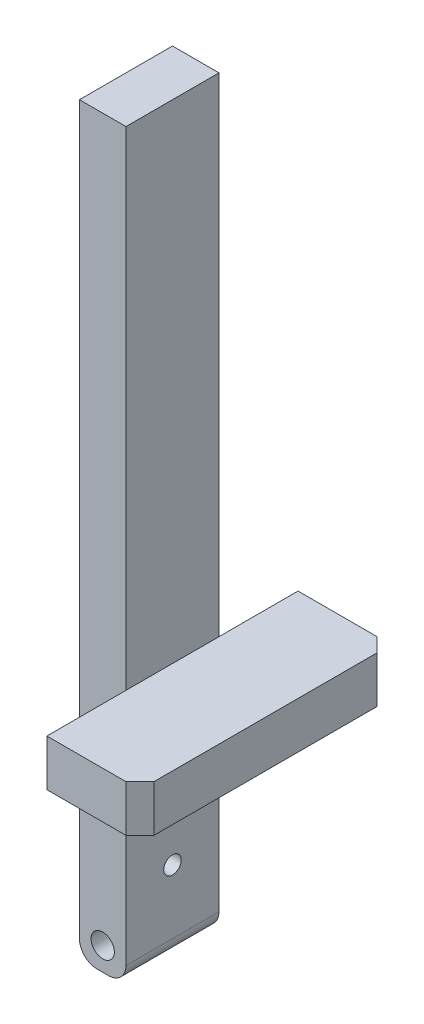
ISO-10303-21;
HEADER;
FILE_DESCRIPTION(('STEP AP214'),'2;1');
FILE_NAME('part.step','',(''),(''),'','','');
FILE_SCHEMA(('AUTOMOTIVE_DESIGN { 1 0 10303 214 1 1 1 1 }'));
ENDSEC;
DATA;
#1=APPLICATION_CONTEXT('core data for automotive mechanical design processes');
#2=APPLICATION_PROTOCOL_DEFINITION('international standard','automotive_design',2000,#1);
#3=PRODUCT_CONTEXT('',#1,'mechanical');
#4=PRODUCT('Part','Part','',(#3));
#5=PRODUCT_RELATED_PRODUCT_CATEGORY('part','',(#4));
#6=PRODUCT_DEFINITION_FORMATION('','',#4);
#7=PRODUCT_DEFINITION_CONTEXT('part definition',#1,'design');
#8=PRODUCT_DEFINITION('design','',#6,#7);
#9=PRODUCT_DEFINITION_SHAPE('','',#8);
#10=(LENGTH_UNIT() NAMED_UNIT(*) SI_UNIT(.MILLI.,.METRE.));
#11=(NAMED_UNIT(*) PLANE_ANGLE_UNIT() SI_UNIT($,.RADIAN.));
#12=(NAMED_UNIT(*) SI_UNIT($,.STERADIAN.) SOLID_ANGLE_UNIT());
#13=UNCERTAINTY_MEASURE_WITH_UNIT(LENGTH_MEASURE(1.E-05),#10,'distance_accuracy_value','');
#14=(GEOMETRIC_REPRESENTATION_CONTEXT(3) GLOBAL_UNCERTAINTY_ASSIGNED_CONTEXT((#13)) GLOBAL_UNIT_ASSIGNED_CONTEXT((#10,
#11,#12)) REPRESENTATION_CONTEXT('',''));
#15=CARTESIAN_POINT('',(0.,0.,0.));
#16=DIRECTION('',(0.,0.,1.));
#17=DIRECTION('',(1.,0.,0.));
#18=AXIS2_PLACEMENT_3D('',#15,#16,#17);
#19=CARTESIAN_POINT('',(6.35000000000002,50.8,34.29));
#20=DIRECTION('',(1.,0.,0.));
#21=DIRECTION('',(0.,1.,0.));
#22=AXIS2_PLACEMENT_3D('',#19,#20,#21);
#23=PLANE('',#22);
#24=CARTESIAN_POINT('',(6.35000000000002,57.15,-6.35));
#25=DIRECTION('',(1.,0.,0.));
#26=DIRECTION('',(0.,1.,0.));
#27=AXIS2_PLACEMENT_3D('',#24,#25,#26);
#28=CIRCLE('',#27,2.3876);
#29=CARTESIAN_POINT('',(6.35000000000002,59.5376,-6.35));
#30=VERTEX_POINT('',#29);
#31=EDGE_CURVE('E149',#30,#30,#28,.F.);
#32=ORIENTED_EDGE('',*,*,#31,.F.);
#33=EDGE_LOOP('',(#32));
#34=FACE_BOUND('',#33,.T.);
#35=DIRECTION('',(0.,-1.,0.));
#36=VECTOR('',#35,1.);
#37=CARTESIAN_POINT('',(6.35000000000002,50.8,-34.29));
#38=LINE('',#37,#36);
#39=CARTESIAN_POINT('',(6.35000000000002,63.5,-34.29));
#40=VERTEX_POINT('',#39);
#41=CARTESIAN_POINT('',(6.35000000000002,50.8,-34.29));
#42=VERTEX_POINT('',#41);
#43=EDGE_CURVE('E138',#40,#42,#38,.T.);
#44=ORIENTED_EDGE('',*,*,#43,.T.);
#45=DIRECTION('',(0.,0.,-1.));
#46=VECTOR('',#45,1.);
#47=CARTESIAN_POINT('',(6.35000000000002,50.8,34.29));
#48=LINE('',#47,#46);
#49=CARTESIAN_POINT('',(6.35000000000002,50.8,34.29));
#50=VERTEX_POINT('',#49);
#51=EDGE_CURVE('E121',#50,#42,#48,.T.);
#52=ORIENTED_EDGE('',*,*,#51,.F.);
#53=DIRECTION('',(0.,-1.,0.));
#54=VECTOR('',#53,1.);
#55=CARTESIAN_POINT('',(6.35000000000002,50.8,34.29));
#56=LINE('',#55,#54);
#57=CARTESIAN_POINT('',(6.35000000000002,63.5,34.29));
#58=VERTEX_POINT('',#57);
#59=EDGE_CURVE('E126',#58,#50,#56,.T.);
#60=ORIENTED_EDGE('',*,*,#59,.F.);
#61=DIRECTION('',(0.,0.,-1.));
#62=VECTOR('',#61,1.);
#63=CARTESIAN_POINT('',(6.35000000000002,63.5,34.29));
#64=LINE('',#63,#62);
#65=EDGE_CURVE('E180',#58,#40,#64,.T.);
#66=ORIENTED_EDGE('',*,*,#65,.T.);
#67=EDGE_LOOP('',(#44,#52,#60,#66));
#68=FACE_BOUND('',#67,.T.);
#69=CARTESIAN_POINT('',(6.35000000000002,57.15,6.35));
#70=DIRECTION('',(1.,0.,0.));
#71=DIRECTION('',(0.,1.,0.));
#72=AXIS2_PLACEMENT_3D('',#69,#70,#71);
#73=CIRCLE('',#72,2.3876);
#74=CARTESIAN_POINT('',(6.35000000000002,59.5376,6.35));
#75=VERTEX_POINT('',#74);
#76=EDGE_CURVE('E152',#75,#75,#73,.F.);
#77=ORIENTED_EDGE('',*,*,#76,.F.);
#78=EDGE_LOOP('',(#77));
#79=FACE_BOUND('',#78,.T.);
#80=ADVANCED_FACE('F64',(#34,#68,#79),#23,.F.);
#81=CARTESIAN_POINT('',(6.35000000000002,50.8,34.29));
#82=DIRECTION('',(0.,1.,0.));
#83=DIRECTION('',(0.,0.,1.));
#84=AXIS2_PLACEMENT_3D('',#81,#82,#83);
#85=PLANE('',#84);
#86=DIRECTION('',(1.,0.,0.));
#87=VECTOR('',#86,1.);
#88=CARTESIAN_POINT('',(6.35000000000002,50.8,-34.29));
#89=LINE('',#88,#87);
#90=CARTESIAN_POINT('',(27.94,50.8,-34.29));
#91=VERTEX_POINT('',#90);
#92=EDGE_CURVE('E164',#42,#91,#89,.T.);
#93=ORIENTED_EDGE('',*,*,#92,.T.);
#94=DIRECTION('',(-0.707106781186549,0.,-0.707106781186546));
#95=VECTOR('',#94,1.);
#96=CARTESIAN_POINT('',(31.75,50.8,-30.48));
#97=LINE('',#96,#95);
#98=CARTESIAN_POINT('',(31.75,50.8,-30.48));
#99=VERTEX_POINT('',#98);
#100=EDGE_CURVE('E72',#91,#99,#97,.F.);
#101=ORIENTED_EDGE('',*,*,#100,.T.);
#102=DIRECTION('',(0.,0.,-1.));
#103=VECTOR('',#102,1.);
#104=CARTESIAN_POINT('',(31.75,50.8,34.29));
#105=LINE('',#104,#103);
#106=CARTESIAN_POINT('',(31.75,50.8,30.48));
#107=VERTEX_POINT('',#106);
#108=EDGE_CURVE('E140',#107,#99,#105,.T.);
#109=ORIENTED_EDGE('',*,*,#108,.F.);
#110=DIRECTION('',(-0.707106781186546,0.,0.707106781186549));
#111=VECTOR('',#110,1.);
#112=CARTESIAN_POINT('',(27.94,50.8,34.29));
#113=LINE('',#112,#111);
#114=CARTESIAN_POINT('',(27.94,50.8,34.29));
#115=VERTEX_POINT('',#114);
#116=EDGE_CURVE('E79',#107,#115,#113,.T.);
#117=ORIENTED_EDGE('',*,*,#116,.T.);
#118=DIRECTION('',(1.,0.,0.));
#119=VECTOR('',#118,1.);
#120=CARTESIAN_POINT('',(6.35000000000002,50.8,34.29));
#121=LINE('',#120,#119);
#122=EDGE_CURVE('E117',#50,#115,#121,.T.);
#123=ORIENTED_EDGE('',*,*,#122,.F.);
#124=ORIENTED_EDGE('',*,*,#51,.T.);
#125=EDGE_LOOP('',(#93,#101,#109,#117,#123,#124));
#126=FACE_BOUND('',#125,.T.);
#127=ADVANCED_FACE('F119',(#126),#85,.F.);
#128=CARTESIAN_POINT('',(31.75,50.8,34.29));
#129=DIRECTION('',(-1.,0.,0.));
#130=DIRECTION('',(0.,0.,1.));
#131=AXIS2_PLACEMENT_3D('',#128,#129,#130);
#132=PLANE('',#131);
#133=ORIENTED_EDGE('',*,*,#108,.T.);
#134=DIRECTION('',(0.,1.,0.));
#135=VECTOR('',#134,1.);
#136=CARTESIAN_POINT('',(31.75,50.8,-30.48));
#137=LINE('',#136,#135);
#138=CARTESIAN_POINT('',(31.75,63.5,-30.48));
#139=VERTEX_POINT('',#138);
#140=EDGE_CURVE('E142',#99,#139,#137,.T.);
#141=ORIENTED_EDGE('',*,*,#140,.T.);
#142=DIRECTION('',(0.,0.,-1.));
#143=VECTOR('',#142,1.);
#144=CARTESIAN_POINT('',(31.75,63.5,34.29));
#145=LINE('',#144,#143);
#146=CARTESIAN_POINT('',(31.75,63.5,30.48));
#147=VERTEX_POINT('',#146);
#148=EDGE_CURVE('E145',#147,#139,#145,.T.);
#149=ORIENTED_EDGE('',*,*,#148,.F.);
#150=DIRECTION('',(0.,-1.,0.));
#151=VECTOR('',#150,1.);
#152=CARTESIAN_POINT('',(31.75,50.8,30.48));
#153=LINE('',#152,#151);
#154=EDGE_CURVE('E139',#147,#107,#153,.T.);
#155=ORIENTED_EDGE('',*,*,#154,.T.);
#156=EDGE_LOOP('',(#133,#141,#149,#155));
#157=FACE_BOUND('',#156,.T.);
#158=ADVANCED_FACE('F168',(#157),#132,.F.);
#159=CARTESIAN_POINT('',(31.75,63.5,34.29));
#160=DIRECTION('',(0.,-1.,0.));
#161=DIRECTION('',(0.,0.,-1.));
#162=AXIS2_PLACEMENT_3D('',#159,#160,#161);
#163=PLANE('',#162);
#164=ORIENTED_EDGE('',*,*,#148,.T.);
#165=DIRECTION('',(0.707106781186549,0.,0.707106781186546));
#166=VECTOR('',#165,1.);
#167=CARTESIAN_POINT('',(31.75,63.5,-30.48));
#168=LINE('',#167,#166);
#169=CARTESIAN_POINT('',(27.94,63.5,-34.29));
#170=VERTEX_POINT('',#169);
#171=EDGE_CURVE('E160',#139,#170,#168,.F.);
#172=ORIENTED_EDGE('',*,*,#171,.T.);
#173=DIRECTION('',(-1.,0.,0.));
#174=VECTOR('',#173,1.);
#175=CARTESIAN_POINT('',(31.75,63.5,-34.29));
#176=LINE('',#175,#174);
#177=EDGE_CURVE('E134',#170,#40,#176,.T.);
#178=ORIENTED_EDGE('',*,*,#177,.T.);
#179=ORIENTED_EDGE('',*,*,#65,.F.);
#180=DIRECTION('',(-1.,0.,0.));
#181=VECTOR('',#180,1.);
#182=CARTESIAN_POINT('',(31.75,63.5,34.29));
#183=LINE('',#182,#181);
#184=CARTESIAN_POINT('',(27.94,63.5,34.29));
#185=VERTEX_POINT('',#184);
#186=EDGE_CURVE('E125',#185,#58,#183,.T.);
#187=ORIENTED_EDGE('',*,*,#186,.F.);
#188=DIRECTION('',(0.707106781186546,0.,-0.707106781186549));
#189=VECTOR('',#188,1.);
#190=CARTESIAN_POINT('',(27.94,63.5,34.29));
#191=LINE('',#190,#189);
#192=EDGE_CURVE('E158',#185,#147,#191,.T.);
#193=ORIENTED_EDGE('',*,*,#192,.T.);
#194=EDGE_LOOP('',(#164,#172,#178,#179,#187,#193));
#195=FACE_BOUND('',#194,.T.);
#196=ADVANCED_FACE('F174',(#195),#163,.F.);
#197=CARTESIAN_POINT('',(0.,0.,34.29));
#198=DIRECTION('',(0.,0.,1.));
#199=DIRECTION('',(1.,0.,0.));
#200=AXIS2_PLACEMENT_3D('',#197,#198,#199);
#201=PLANE('',#200);
#202=ORIENTED_EDGE('',*,*,#122,.T.);
#203=DIRECTION('',(0.,1.,0.));
#204=VECTOR('',#203,1.);
#205=CARTESIAN_POINT('',(27.94,63.5,34.29));
#206=LINE('',#205,#204);
#207=EDGE_CURVE('E13',#115,#185,#206,.T.);
#208=ORIENTED_EDGE('',*,*,#207,.T.);
#209=ORIENTED_EDGE('',*,*,#186,.T.);
#210=ORIENTED_EDGE('',*,*,#59,.T.);
#211=EDGE_LOOP('',(#202,#208,#209,#210));
#212=FACE_BOUND('',#211,.T.);
#213=ADVANCED_FACE('F129',(#212),#201,.T.);
#214=CARTESIAN_POINT('',(0.,0.,-34.29));
#215=DIRECTION('',(0.,0.,1.));
#216=DIRECTION('',(1.,0.,0.));
#217=AXIS2_PLACEMENT_3D('',#214,#215,#216);
#218=PLANE('',#217);
#219=ORIENTED_EDGE('',*,*,#177,.F.);
#220=DIRECTION('',(0.,-1.,0.));
#221=VECTOR('',#220,1.);
#222=CARTESIAN_POINT('',(27.94,0.,-34.29));
#223=LINE('',#222,#221);
#224=EDGE_CURVE('E87',#170,#91,#223,.T.);
#225=ORIENTED_EDGE('',*,*,#224,.T.);
#226=ORIENTED_EDGE('',*,*,#92,.F.);
#227=ORIENTED_EDGE('',*,*,#43,.F.);
#228=EDGE_LOOP('',(#219,#225,#226,#227));
#229=FACE_BOUND('',#228,.T.);
#230=ADVANCED_FACE('F175',(#229),#218,.F.);
#231=CARTESIAN_POINT('',(17.78,57.15,-6.35));
#232=DIRECTION('',(-1.,0.,0.));
#233=DIRECTION('',(0.,0.,1.));
#234=AXIS2_PLACEMENT_3D('',#231,#232,#233);
#235=CYLINDRICAL_SURFACE('',#234,2.3876);
#236=CARTESIAN_POINT('',(17.78,57.15,-6.35));
#237=DIRECTION('',(1.,0.,0.));
#238=DIRECTION('',(0.,0.,-1.));
#239=AXIS2_PLACEMENT_3D('',#236,#237,#238);
#240=CIRCLE('',#239,2.3876);
#241=CARTESIAN_POINT('',(17.78,57.15,-8.7376));
#242=VERTEX_POINT('',#241);
#243=EDGE_CURVE('E183',#242,#242,#240,.T.);
#244=ORIENTED_EDGE('',*,*,#243,.T.);
#245=EDGE_LOOP('',(#244));
#246=FACE_BOUND('',#245,.T.);
#247=ORIENTED_EDGE('',*,*,#31,.T.);
#248=EDGE_LOOP('',(#247));
#249=FACE_BOUND('',#248,.T.);
#250=ADVANCED_FACE('F216',(#246,#249),#235,.F.);
#251=CARTESIAN_POINT('',(17.78,57.15,-6.35));
#252=DIRECTION('',(1.,0.,0.));
#253=DIRECTION('',(0.,0.,-1.));
#254=AXIS2_PLACEMENT_3D('',#251,#252,#253);
#255=PLANE('',#254);
#256=ORIENTED_EDGE('',*,*,#243,.F.);
#257=EDGE_LOOP('',(#256));
#258=FACE_BOUND('',#257,.T.);
#259=ADVANCED_FACE('F199',(#258),#255,.F.);
#260=CARTESIAN_POINT('',(17.78,57.15,6.35));
#261=DIRECTION('',(-1.,0.,0.));
#262=DIRECTION('',(0.,0.,1.));
#263=AXIS2_PLACEMENT_3D('',#260,#261,#262);
#264=CYLINDRICAL_SURFACE('',#263,2.3876);
#265=CARTESIAN_POINT('',(17.78,57.15,6.35));
#266=DIRECTION('',(1.,0.,0.));
#267=DIRECTION('',(0.,0.,-1.));
#268=AXIS2_PLACEMENT_3D('',#265,#266,#267);
#269=CIRCLE('',#268,2.3876);
#270=CARTESIAN_POINT('',(17.78,57.15,3.9624));
#271=VERTEX_POINT('',#270);
#272=EDGE_CURVE('E153',#271,#271,#269,.T.);
#273=ORIENTED_EDGE('',*,*,#272,.T.);
#274=EDGE_LOOP('',(#273));
#275=FACE_BOUND('',#274,.T.);
#276=ORIENTED_EDGE('',*,*,#76,.T.);
#277=EDGE_LOOP('',(#276));
#278=FACE_BOUND('',#277,.T.);
#279=ADVANCED_FACE('F189',(#275,#278),#264,.F.);
#280=CARTESIAN_POINT('',(17.78,57.15,6.35));
#281=DIRECTION('',(1.,0.,0.));
#282=DIRECTION('',(0.,0.,-1.));
#283=AXIS2_PLACEMENT_3D('',#280,#281,#282);
#284=PLANE('',#283);
#285=ORIENTED_EDGE('',*,*,#272,.F.);
#286=EDGE_LOOP('',(#285));
#287=FACE_BOUND('',#286,.T.);
#288=ADVANCED_FACE('F192',(#287),#284,.F.);
#289=CARTESIAN_POINT('',(31.75,50.8,-30.48));
#290=DIRECTION('',(-0.707106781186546,0.,0.707106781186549));
#291=DIRECTION('',(0.,1.,0.));
#292=AXIS2_PLACEMENT_3D('',#289,#290,#291);
#293=PLANE('',#292);
#294=ORIENTED_EDGE('',*,*,#100,.F.);
#295=ORIENTED_EDGE('',*,*,#224,.F.);
#296=ORIENTED_EDGE('',*,*,#171,.F.);
#297=ORIENTED_EDGE('',*,*,#140,.F.);
#298=EDGE_LOOP('',(#294,#295,#296,#297));
#299=FACE_BOUND('',#298,.T.);
#300=ADVANCED_FACE('F172',(#299),#293,.F.);
#301=CARTESIAN_POINT('',(27.94,0.,34.29));
#302=DIRECTION('',(0.707106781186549,0.,0.707106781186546));
#303=DIRECTION('',(0.,-1.,0.));
#304=AXIS2_PLACEMENT_3D('',#301,#302,#303);
#305=PLANE('',#304);
#306=ORIENTED_EDGE('',*,*,#116,.F.);
#307=ORIENTED_EDGE('',*,*,#154,.F.);
#308=ORIENTED_EDGE('',*,*,#192,.F.);
#309=ORIENTED_EDGE('',*,*,#207,.F.);
#310=EDGE_LOOP('',(#306,#307,#308,#309));
#311=FACE_BOUND('',#310,.T.);
#312=ADVANCED_FACE('F66',(#311),#305,.T.);
#313=CLOSED_SHELL('',(#80,#127,#158,#196,#213,#230,#250,#259,#279,#288,#300,#312));
#314=MANIFOLD_SOLID_BREP('B2',#313);
#315=CARTESIAN_POINT('',(6.35,-6.35,12.7));
#316=DIRECTION('',(-1.,0.,0.));
#317=DIRECTION('',(0.,-1.,0.));
#318=AXIS2_PLACEMENT_3D('',#315,#316,#317);
#319=PLANE('',#318);
#320=CARTESIAN_POINT('',(6.35,41.275,0.));
#321=DIRECTION('',(-1.,0.,0.));
#322=DIRECTION('',(0.,-1.,0.));
#323=AXIS2_PLACEMENT_3D('',#320,#321,#322);
#324=CIRCLE('',#323,2.3876);
#325=CARTESIAN_POINT('',(6.35,38.8874,0.));
#326=VERTEX_POINT('',#325);
#327=EDGE_CURVE('E420',#326,#326,#324,.T.);
#328=ORIENTED_EDGE('',*,*,#327,.T.);
#329=EDGE_LOOP('',(#328));
#330=FACE_BOUND('',#329,.T.);
#331=CARTESIAN_POINT('',(6.35,15.875,0.));
#332=DIRECTION('',(-1.,0.,0.));
#333=DIRECTION('',(0.,-1.,0.));
#334=AXIS2_PLACEMENT_3D('',#331,#332,#333);
#335=CIRCLE('',#334,2.3876);
#336=CARTESIAN_POINT('',(6.35,13.4874,0.));
#337=VERTEX_POINT('',#336);
#338=EDGE_CURVE('E403',#337,#337,#335,.T.);
#339=ORIENTED_EDGE('',*,*,#338,.T.);
#340=EDGE_LOOP('',(#339));
#341=FACE_BOUND('',#340,.T.);
#342=CARTESIAN_POINT('',(6.35000000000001,57.15,-6.35));
#343=DIRECTION('',(-1.,0.,0.));
#344=DIRECTION('',(0.,-1.,0.));
#345=AXIS2_PLACEMENT_3D('',#342,#343,#344);
#346=CIRCLE('',#345,2.3876);
#347=CARTESIAN_POINT('',(6.35000000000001,54.7624,-6.35));
#348=VERTEX_POINT('',#347);
#349=EDGE_CURVE('E402',#348,#348,#346,.F.);
#350=ORIENTED_EDGE('',*,*,#349,.F.);
#351=EDGE_LOOP('',(#350));
#352=FACE_BOUND('',#351,.T.);
#353=DIRECTION('',(0.,1.,0.));
#354=VECTOR('',#353,1.);
#355=CARTESIAN_POINT('',(6.35,-6.35,12.7));
#356=LINE('',#355,#354);
#357=CARTESIAN_POINT('',(6.35,-1.5748,12.7));
#358=VERTEX_POINT('',#357);
#359=CARTESIAN_POINT('',(6.35000000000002,196.85,12.7));
#360=VERTEX_POINT('',#359);
#361=EDGE_CURVE('E361',#358,#360,#356,.T.);
#362=ORIENTED_EDGE('',*,*,#361,.F.);
#363=DIRECTION('',(0.,0.,-1.));
#364=VECTOR('',#363,1.);
#365=CARTESIAN_POINT('',(6.35,-1.5748,12.7));
#366=LINE('',#365,#364);
#367=CARTESIAN_POINT('',(6.35,-1.5748,-12.7));
#368=VERTEX_POINT('',#367);
#369=EDGE_CURVE('E62',#358,#368,#366,.T.);
#370=ORIENTED_EDGE('',*,*,#369,.T.);
#371=DIRECTION('',(0.,1.,0.));
#372=VECTOR('',#371,1.);
#373=CARTESIAN_POINT('',(6.35,-6.35,-12.7));
#374=LINE('',#373,#372);
#375=CARTESIAN_POINT('',(6.35000000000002,196.85,-12.7));
#376=VERTEX_POINT('',#375);
#377=EDGE_CURVE('E376',#368,#376,#374,.T.);
#378=ORIENTED_EDGE('',*,*,#377,.T.);
#379=DIRECTION('',(0.,0.,-1.));
#380=VECTOR('',#379,1.);
#381=CARTESIAN_POINT('',(6.35000000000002,196.85,12.7));
#382=LINE('',#381,#380);
#383=EDGE_CURVE('E373',#360,#376,#382,.T.);
#384=ORIENTED_EDGE('',*,*,#383,.F.);
#385=EDGE_LOOP('',(#362,#370,#378,#384));
#386=FACE_BOUND('',#385,.T.);
#387=CARTESIAN_POINT('',(6.35000000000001,57.15,6.35));
#388=DIRECTION('',(-1.,0.,0.));
#389=DIRECTION('',(0.,-1.,0.));
#390=AXIS2_PLACEMENT_3D('',#387,#388,#389);
#391=CIRCLE('',#390,2.3876);
#392=CARTESIAN_POINT('',(6.35000000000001,54.7624,6.35));
#393=VERTEX_POINT('',#392);
#394=EDGE_CURVE('E407',#393,#393,#391,.F.);
#395=ORIENTED_EDGE('',*,*,#394,.F.);
#396=EDGE_LOOP('',(#395));
#397=FACE_BOUND('',#396,.T.);
#398=ADVANCED_FACE('F306',(#330,#341,#352,#386,#397),#319,.F.);
#399=CARTESIAN_POINT('',(-6.35000000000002,196.85,12.7));
#400=DIRECTION('',(1.,0.,0.));
#401=DIRECTION('',(0.,1.,0.));
#402=AXIS2_PLACEMENT_3D('',#399,#400,#401);
#403=PLANE('',#402);
#404=CARTESIAN_POINT('',(-6.35000000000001,41.275,0.));
#405=DIRECTION('',(1.,0.,0.));
#406=DIRECTION('',(0.,1.,0.));
#407=AXIS2_PLACEMENT_3D('',#404,#405,#406);
#408=CIRCLE('',#407,2.3876);
#409=CARTESIAN_POINT('',(-6.35000000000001,43.6626,0.));
#410=VERTEX_POINT('',#409);
#411=EDGE_CURVE('E310',#410,#410,#408,.T.);
#412=ORIENTED_EDGE('',*,*,#411,.T.);
#413=EDGE_LOOP('',(#412));
#414=FACE_BOUND('',#413,.T.);
#415=CARTESIAN_POINT('',(-6.35,15.875,0.));
#416=DIRECTION('',(1.,0.,0.));
#417=DIRECTION('',(0.,1.,0.));
#418=AXIS2_PLACEMENT_3D('',#415,#416,#417);
#419=CIRCLE('',#418,2.3876);
#420=CARTESIAN_POINT('',(-6.35,18.2626,0.));
#421=VERTEX_POINT('',#420);
#422=EDGE_CURVE('E418',#421,#421,#419,.T.);
#423=ORIENTED_EDGE('',*,*,#422,.T.);
#424=EDGE_LOOP('',(#423));
#425=FACE_BOUND('',#424,.T.);
#426=CARTESIAN_POINT('',(-6.35000000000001,57.15,-6.35));
#427=DIRECTION('',(1.,0.,0.));
#428=DIRECTION('',(0.,1.,0.));
#429=AXIS2_PLACEMENT_3D('',#426,#427,#428);
#430=CIRCLE('',#429,2.3876);
#431=CARTESIAN_POINT('',(-6.35000000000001,59.5376,-6.35));
#432=VERTEX_POINT('',#431);
#433=EDGE_CURVE('E399',#432,#432,#430,.F.);
#434=ORIENTED_EDGE('',*,*,#433,.F.);
#435=EDGE_LOOP('',(#434));
#436=FACE_BOUND('',#435,.T.);
#437=DIRECTION('',(0.,-1.,0.));
#438=VECTOR('',#437,1.);
#439=CARTESIAN_POINT('',(-6.35000000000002,196.85,-12.7));
#440=LINE('',#439,#438);
#441=CARTESIAN_POINT('',(-6.35000000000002,196.85,-12.7));
#442=VERTEX_POINT('',#441);
#443=CARTESIAN_POINT('',(-6.35,-1.57479999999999,-12.7));
#444=VERTEX_POINT('',#443);
#445=EDGE_CURVE('E396',#442,#444,#440,.T.);
#446=ORIENTED_EDGE('',*,*,#445,.T.);
#447=DIRECTION('',(0.,0.,-1.));
#448=VECTOR('',#447,1.);
#449=CARTESIAN_POINT('',(-6.35,-1.57479999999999,12.7));
#450=LINE('',#449,#448);
#451=CARTESIAN_POINT('',(-6.35,-1.57479999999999,12.7));
#452=VERTEX_POINT('',#451);
#453=EDGE_CURVE('E331',#444,#452,#450,.F.);
#454=ORIENTED_EDGE('',*,*,#453,.T.);
#455=DIRECTION('',(0.,-1.,0.));
#456=VECTOR('',#455,1.);
#457=CARTESIAN_POINT('',(-6.35000000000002,196.85,12.7));
#458=LINE('',#457,#456);
#459=CARTESIAN_POINT('',(-6.35000000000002,196.85,12.7));
#460=VERTEX_POINT('',#459);
#461=EDGE_CURVE('E384',#460,#452,#458,.T.);
#462=ORIENTED_EDGE('',*,*,#461,.F.);
#463=DIRECTION('',(0.,0.,-1.));
#464=VECTOR('',#463,1.);
#465=CARTESIAN_POINT('',(-6.35000000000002,196.85,12.7));
#466=LINE('',#465,#464);
#467=EDGE_CURVE('E380',#460,#442,#466,.T.);
#468=ORIENTED_EDGE('',*,*,#467,.T.);
#469=EDGE_LOOP('',(#446,#454,#462,#468));
#470=FACE_BOUND('',#469,.T.);
#471=CARTESIAN_POINT('',(-6.35000000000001,57.15,6.35));
#472=DIRECTION('',(1.,0.,0.));
#473=DIRECTION('',(0.,1.,0.));
#474=AXIS2_PLACEMENT_3D('',#471,#472,#473);
#475=CIRCLE('',#474,2.3876);
#476=CARTESIAN_POINT('',(-6.35000000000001,59.5376,6.35));
#477=VERTEX_POINT('',#476);
#478=EDGE_CURVE('E404',#477,#477,#475,.F.);
#479=ORIENTED_EDGE('',*,*,#478,.F.);
#480=EDGE_LOOP('',(#479));
#481=FACE_BOUND('',#480,.T.);
#482=ADVANCED_FACE('F450',(#414,#425,#436,#470,#481),#403,.F.);
#483=CARTESIAN_POINT('',(0.,0.,12.7));
#484=DIRECTION('',(0.,0.,1.));
#485=DIRECTION('',(1.,0.,0.));
#486=AXIS2_PLACEMENT_3D('',#483,#484,#485);
#487=PLANE('',#486);
#488=ORIENTED_EDGE('',*,*,#461,.T.);
#489=CARTESIAN_POINT('',(-1.5748,-1.5748,12.7));
#490=DIRECTION('',(0.,0.,1.));
#491=DIRECTION('',(1.,0.,0.));
#492=AXIS2_PLACEMENT_3D('',#489,#490,#491);
#493=CIRCLE('',#492,4.7752);
#494=CARTESIAN_POINT('',(-1.5748,-6.35,12.7));
#495=VERTEX_POINT('',#494);
#496=EDGE_CURVE('E315',#452,#495,#493,.T.);
#497=ORIENTED_EDGE('',*,*,#496,.T.);
#498=DIRECTION('',(1.,0.,0.));
#499=VECTOR('',#498,1.);
#500=CARTESIAN_POINT('',(-6.35,-6.35,12.7));
#501=LINE('',#500,#499);
#502=CARTESIAN_POINT('',(1.5748,-6.35,12.7));
#503=VERTEX_POINT('',#502);
#504=EDGE_CURVE('E370',#495,#503,#501,.T.);
#505=ORIENTED_EDGE('',*,*,#504,.T.);
#506=CARTESIAN_POINT('',(1.5748,-1.5748,12.7));
#507=DIRECTION('',(0.,0.,1.));
#508=DIRECTION('',(1.,0.,0.));
#509=AXIS2_PLACEMENT_3D('',#506,#507,#508);
#510=CIRCLE('',#509,4.7752);
#511=EDGE_CURVE('E323',#503,#358,#510,.T.);
#512=ORIENTED_EDGE('',*,*,#511,.T.);
#513=ORIENTED_EDGE('',*,*,#361,.T.);
#514=DIRECTION('',(-1.,0.,0.));
#515=VECTOR('',#514,1.);
#516=CARTESIAN_POINT('',(6.35000000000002,196.85,12.7));
#517=LINE('',#516,#515);
#518=EDGE_CURVE('E366',#360,#460,#517,.T.);
#519=ORIENTED_EDGE('',*,*,#518,.T.);
#520=EDGE_LOOP('',(#488,#497,#505,#512,#513,#519));
#521=FACE_BOUND('',#520,.T.);
#522=CARTESIAN_POINT('',(0.,0.,12.7));
#523=DIRECTION('',(0.,0.,1.));
#524=DIRECTION('',(1.,0.,0.));
#525=AXIS2_PLACEMENT_3D('',#522,#523,#524);
#526=CIRCLE('',#525,3.175);
#527=CARTESIAN_POINT('',(3.175,0.,12.7));
#528=VERTEX_POINT('',#527);
#529=EDGE_CURVE('E392',#528,#528,#526,.T.);
#530=ORIENTED_EDGE('',*,*,#529,.F.);
#531=EDGE_LOOP('',(#530));
#532=FACE_BOUND('',#531,.T.);
#533=ADVANCED_FACE('F363',(#521,#532),#487,.T.);
#534=CARTESIAN_POINT('',(0.,0.,-12.7));
#535=DIRECTION('',(0.,0.,1.));
#536=DIRECTION('',(1.,0.,0.));
#537=AXIS2_PLACEMENT_3D('',#534,#535,#536);
#538=PLANE('',#537);
#539=DIRECTION('',(1.,0.,0.));
#540=VECTOR('',#539,1.);
#541=CARTESIAN_POINT('',(-6.35,-6.35,-12.7));
#542=LINE('',#541,#540);
#543=CARTESIAN_POINT('',(-1.5748,-6.35,-12.7));
#544=VERTEX_POINT('',#543);
#545=CARTESIAN_POINT('',(1.5748,-6.35,-12.7));
#546=VERTEX_POINT('',#545);
#547=EDGE_CURVE('E389',#544,#546,#542,.T.);
#548=ORIENTED_EDGE('',*,*,#547,.F.);
#549=CARTESIAN_POINT('',(-1.5748,-1.5748,-12.7));
#550=DIRECTION('',(0.,0.,1.));
#551=DIRECTION('',(1.,0.,0.));
#552=AXIS2_PLACEMENT_3D('',#549,#550,#551);
#553=CIRCLE('',#552,4.7752);
#554=EDGE_CURVE('E414',#544,#444,#553,.F.);
#555=ORIENTED_EDGE('',*,*,#554,.T.);
#556=ORIENTED_EDGE('',*,*,#445,.F.);
#557=DIRECTION('',(-1.,0.,0.));
#558=VECTOR('',#557,1.);
#559=CARTESIAN_POINT('',(6.35000000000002,196.85,-12.7));
#560=LINE('',#559,#558);
#561=EDGE_CURVE('E394',#376,#442,#560,.T.);
#562=ORIENTED_EDGE('',*,*,#561,.F.);
#563=ORIENTED_EDGE('',*,*,#377,.F.);
#564=CARTESIAN_POINT('',(1.5748,-1.5748,-12.7));
#565=DIRECTION('',(0.,0.,1.));
#566=DIRECTION('',(1.,0.,0.));
#567=AXIS2_PLACEMENT_3D('',#564,#565,#566);
#568=CIRCLE('',#567,4.7752);
#569=EDGE_CURVE('E412',#368,#546,#568,.F.);
#570=ORIENTED_EDGE('',*,*,#569,.T.);
#571=EDGE_LOOP('',(#548,#555,#556,#562,#563,#570));
#572=FACE_BOUND('',#571,.T.);
#573=CARTESIAN_POINT('',(0.,0.,-12.7));
#574=DIRECTION('',(0.,0.,1.));
#575=DIRECTION('',(1.,0.,0.));
#576=AXIS2_PLACEMENT_3D('',#573,#574,#575);
#577=CIRCLE('',#576,3.175);
#578=CARTESIAN_POINT('',(3.175,0.,-12.7));
#579=VERTEX_POINT('',#578);
#580=EDGE_CURVE('E435',#579,#579,#577,.T.);
#581=ORIENTED_EDGE('',*,*,#580,.T.);
#582=EDGE_LOOP('',(#581));
#583=FACE_BOUND('',#582,.T.);
#584=ADVANCED_FACE('F447',(#572,#583),#538,.F.);
#585=CARTESIAN_POINT('',(-6.35,-6.35,12.7));
#586=DIRECTION('',(0.,1.,0.));
#587=DIRECTION('',(0.,0.,1.));
#588=AXIS2_PLACEMENT_3D('',#585,#586,#587);
#589=PLANE('',#588);
#590=ORIENTED_EDGE('',*,*,#504,.F.);
#591=DIRECTION('',(0.,0.,-1.));
#592=VECTOR('',#591,1.);
#593=CARTESIAN_POINT('',(-1.5748,-6.35,12.7));
#594=LINE('',#593,#592);
#595=EDGE_CURVE('E409',#495,#544,#594,.T.);
#596=ORIENTED_EDGE('',*,*,#595,.T.);
#597=ORIENTED_EDGE('',*,*,#547,.T.);
#598=DIRECTION('',(0.,0.,-1.));
#599=VECTOR('',#598,1.);
#600=CARTESIAN_POINT('',(1.5748,-6.35,12.7));
#601=LINE('',#600,#599);
#602=EDGE_CURVE('E379',#546,#503,#601,.F.);
#603=ORIENTED_EDGE('',*,*,#602,.T.);
#604=EDGE_LOOP('',(#590,#596,#597,#603));
#605=FACE_BOUND('',#604,.T.);
#606=ADVANCED_FACE('F454',(#605),#589,.F.);
#607=CARTESIAN_POINT('',(6.35000000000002,196.85,12.7));
#608=DIRECTION('',(0.,-1.,0.));
#609=DIRECTION('',(0.,0.,-1.));
#610=AXIS2_PLACEMENT_3D('',#607,#608,#609);
#611=PLANE('',#610);
#612=ORIENTED_EDGE('',*,*,#561,.T.);
#613=ORIENTED_EDGE('',*,*,#467,.F.);
#614=ORIENTED_EDGE('',*,*,#518,.F.);
#615=ORIENTED_EDGE('',*,*,#383,.T.);
#616=EDGE_LOOP('',(#612,#613,#614,#615));
#617=FACE_BOUND('',#616,.T.);
#618=ADVANCED_FACE('F382',(#617),#611,.F.);
#619=CARTESIAN_POINT('',(0.,0.,12.7));
#620=DIRECTION('',(0.,0.,-1.));
#621=DIRECTION('',(-1.,0.,0.));
#622=AXIS2_PLACEMENT_3D('',#619,#620,#621);
#623=CYLINDRICAL_SURFACE('',#622,3.175);
#624=ORIENTED_EDGE('',*,*,#529,.T.);
#625=EDGE_LOOP('',(#624));
#626=FACE_BOUND('',#625,.T.);
#627=ORIENTED_EDGE('',*,*,#580,.F.);
#628=EDGE_LOOP('',(#627));
#629=FACE_BOUND('',#628,.T.);
#630=ADVANCED_FACE('F461',(#626,#629),#623,.F.);
#631=CARTESIAN_POINT('',(17.78,57.15,-6.35));
#632=DIRECTION('',(-1.,0.,0.));
#633=DIRECTION('',(0.,0.,1.));
#634=AXIS2_PLACEMENT_3D('',#631,#632,#633);
#635=CYLINDRICAL_SURFACE('',#634,2.3876);
#636=ORIENTED_EDGE('',*,*,#433,.T.);
#637=EDGE_LOOP('',(#636));
#638=FACE_BOUND('',#637,.T.);
#639=ORIENTED_EDGE('',*,*,#349,.T.);
#640=EDGE_LOOP('',(#639));
#641=FACE_BOUND('',#640,.T.);
#642=ADVANCED_FACE('F477',(#638,#641),#635,.F.);
#643=CARTESIAN_POINT('',(17.78,57.15,6.35));
#644=DIRECTION('',(-1.,0.,0.));
#645=DIRECTION('',(0.,0.,1.));
#646=AXIS2_PLACEMENT_3D('',#643,#644,#645);
#647=CYLINDRICAL_SURFACE('',#646,2.3876);
#648=ORIENTED_EDGE('',*,*,#478,.T.);
#649=EDGE_LOOP('',(#648));
#650=FACE_BOUND('',#649,.T.);
#651=ORIENTED_EDGE('',*,*,#394,.T.);
#652=EDGE_LOOP('',(#651));
#653=FACE_BOUND('',#652,.T.);
#654=ADVANCED_FACE('F481',(#650,#653),#647,.F.);
#655=CARTESIAN_POINT('',(-1.5748,-1.5748,12.7));
#656=DIRECTION('',(0.,0.,-1.));
#657=DIRECTION('',(-1.,0.,0.));
#658=AXIS2_PLACEMENT_3D('',#655,#656,#657);
#659=CYLINDRICAL_SURFACE('',#658,4.7752);
#660=ORIENTED_EDGE('',*,*,#496,.F.);
#661=ORIENTED_EDGE('',*,*,#453,.F.);
#662=ORIENTED_EDGE('',*,*,#554,.F.);
#663=ORIENTED_EDGE('',*,*,#595,.F.);
#664=EDGE_LOOP('',(#660,#661,#662,#663));
#665=FACE_BOUND('',#664,.T.);
#666=ADVANCED_FACE('F453',(#665),#659,.T.);
#667=CARTESIAN_POINT('',(1.5748,-1.5748,12.7));
#668=DIRECTION('',(0.,0.,-1.));
#669=DIRECTION('',(-1.,0.,0.));
#670=AXIS2_PLACEMENT_3D('',#667,#668,#669);
#671=CYLINDRICAL_SURFACE('',#670,4.7752);
#672=ORIENTED_EDGE('',*,*,#511,.F.);
#673=ORIENTED_EDGE('',*,*,#602,.F.);
#674=ORIENTED_EDGE('',*,*,#569,.F.);
#675=ORIENTED_EDGE('',*,*,#369,.F.);
#676=EDGE_LOOP('',(#672,#673,#674,#675));
#677=FACE_BOUND('',#676,.T.);
#678=ADVANCED_FACE('F308',(#677),#671,.T.);
#679=CARTESIAN_POINT('',(-12.7,15.875,0.));
#680=DIRECTION('',(1.,0.,0.));
#681=DIRECTION('',(0.,0.,-1.));
#682=AXIS2_PLACEMENT_3D('',#679,#680,#681);
#683=CYLINDRICAL_SURFACE('',#682,2.3876);
#684=ORIENTED_EDGE('',*,*,#422,.F.);
#685=EDGE_LOOP('',(#684));
#686=FACE_BOUND('',#685,.T.);
#687=ORIENTED_EDGE('',*,*,#338,.F.);
#688=EDGE_LOOP('',(#687));
#689=FACE_BOUND('',#688,.T.);
#690=ADVANCED_FACE('F486',(#686,#689),#683,.F.);
#691=CARTESIAN_POINT('',(-12.7,41.275,0.));
#692=DIRECTION('',(1.,0.,0.));
#693=DIRECTION('',(0.,0.,-1.));
#694=AXIS2_PLACEMENT_3D('',#691,#692,#693);
#695=CYLINDRICAL_SURFACE('',#694,2.3876);
#696=ORIENTED_EDGE('',*,*,#411,.F.);
#697=EDGE_LOOP('',(#696));
#698=FACE_BOUND('',#697,.T.);
#699=ORIENTED_EDGE('',*,*,#327,.F.);
#700=EDGE_LOOP('',(#699));
#701=FACE_BOUND('',#700,.T.);
#702=ADVANCED_FACE('F489',(#698,#701),#695,.F.);
#703=CLOSED_SHELL('',(#398,#482,#533,#584,#606,#618,#630,#642,#654,#666,#678,#690,#702));
#704=MANIFOLD_SOLID_BREP('B7',#703);
#705=ADVANCED_BREP_SHAPE_REPRESENTATION('',(#18,#314,#704),#14);
#706=SHAPE_DEFINITION_REPRESENTATION(#9,#705);
ENDSEC;
END-ISO-10303-21;
